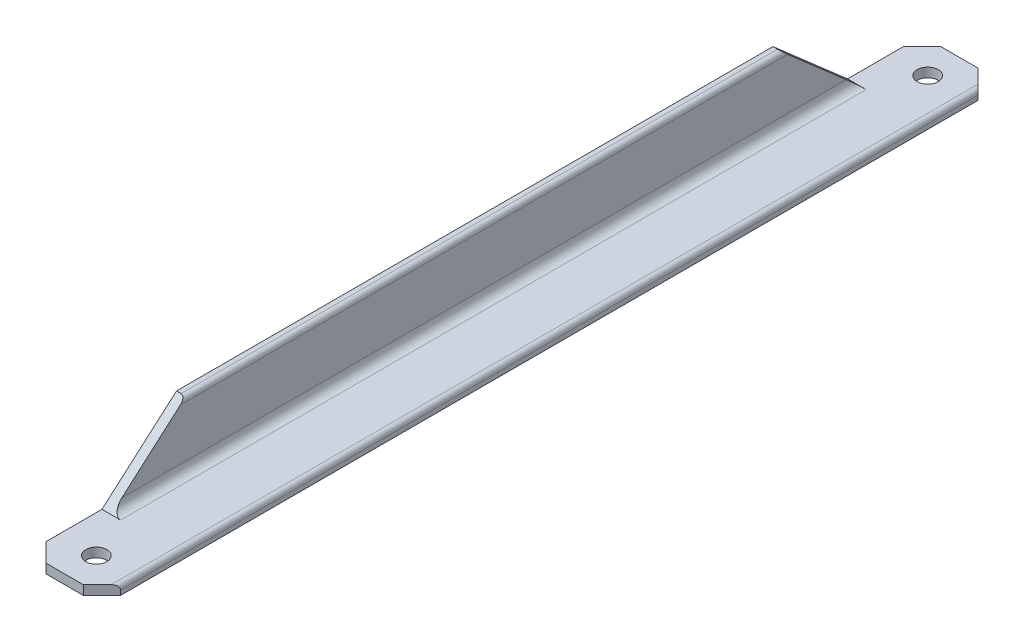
from build123d import *

# Parameters (mm, degrees)
BOSS_EXTRUDE1_DEPTH     = 304.8
CUT_EXTRUDE1_DEPTH      = 313.185013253
CUT_EXTRUDE1_DEPTH_BACK = 313.185013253
CUT_EXTRUDE2_DEPTH      = 313.185013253
CUT_EXTRUDE2_DEPTH_BACK = 313.185013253
CUT_EXTRUDE3_DEPTH      = 313.185013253
CUT_EXTRUDE3_DEPTH_BACK = 313.185013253
SKETCH4_R               = 7.1374


with BuildPart() as part:
    # Sketch1 → Boss-Extrude1 (new, symmetric)
    with BuildSketch(Plane.XY):
        with BuildLine():
            Line((0, 0), (0, 50.8))
            Line((0, 50.8), (3.175, 50.8))
            ThreePointArc((3.175, 50.8), (5.42006403, 49.87006403), (6.35, 47.625))
            Line((6.35, 47.625), (6.35, 12.7))
            ThreePointArc((6.35, 12.7), (8.209871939, 8.209871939), (12.7, 6.35))
            Line((12.7, 6.35), (47.625, 6.35))
            ThreePointArc((47.625, 6.35), (49.87006403, 5.42006403), (50.8, 3.175))
            Line((50.8, 3.175), (50.8, 0))
            Line((50.8, 0), (0, 0))
        make_face()
    extrude(amount=BOSS_EXTRUDE1_DEPTH, both=True)

    # Sketch2 → Cut-Extrude1 (cut, two sides: drawn at the far end of the back side and taken through both)
    with BuildSketch(Plane(origin=(6.35, 0, 0), x_dir=(0, 0, -1), z_dir=(1, 0, 0)).offset(-CUT_EXTRUDE1_DEPTH_BACK)):
        Polygon((-304.8, 6.35), (-254, 6.35), (-203.2, 50.8), (-304.8, 50.8), align=None)
        Polygon((304.8, 50.8), (304.8, 6.35), (254, 6.35), (203.2, 50.8), align=None)
    extrude(amount=CUT_EXTRUDE1_DEPTH + CUT_EXTRUDE1_DEPTH_BACK, mode=Mode.SUBTRACT)

    # Sketch3 → Cut-Extrude2 (cut, two sides: drawn at the far end of the back side and taken through both)
    with BuildSketch(Plane(origin=(0, 6.35, 0), x_dir=(1, 0, 0), z_dir=(0, 1, 0)).offset(-CUT_EXTRUDE2_DEPTH_BACK)):
        Polygon((0, 304.8), (12.7, 304.8), (0, 292.1), align=None)
        Polygon((50.8, 304.8), (38.1, 304.8), (50.8, 292.1), align=None)
        Polygon((50.8, -292.1), (50.8, -304.8), (38.1, -304.8), align=None)
        Polygon((0, -292.1), (0, -304.8), (12.7, -304.8), align=None)
    extrude(amount=CUT_EXTRUDE2_DEPTH + CUT_EXTRUDE2_DEPTH_BACK, mode=Mode.SUBTRACT)

    # Sketch4 → Cut-Extrude3 (cut, two sides: drawn at the far end of the back side and taken through both)
    with BuildSketch(Plane(origin=(0, 6.35, 0), x_dir=(1, 0, 0), z_dir=(0, 1, 0)).offset(-CUT_EXTRUDE3_DEPTH_BACK)):
        with Locations(Location((25.4, 283.21, 0), (0, 0, 270))):
            Circle(SKETCH4_R)
        with Locations(Location((25.4, -283.21, 0), (0, 0, 90))):
            Circle(SKETCH4_R)
    extrude(amount=CUT_EXTRUDE3_DEPTH + CUT_EXTRUDE3_DEPTH_BACK, mode=Mode.SUBTRACT)


solid = part.part
